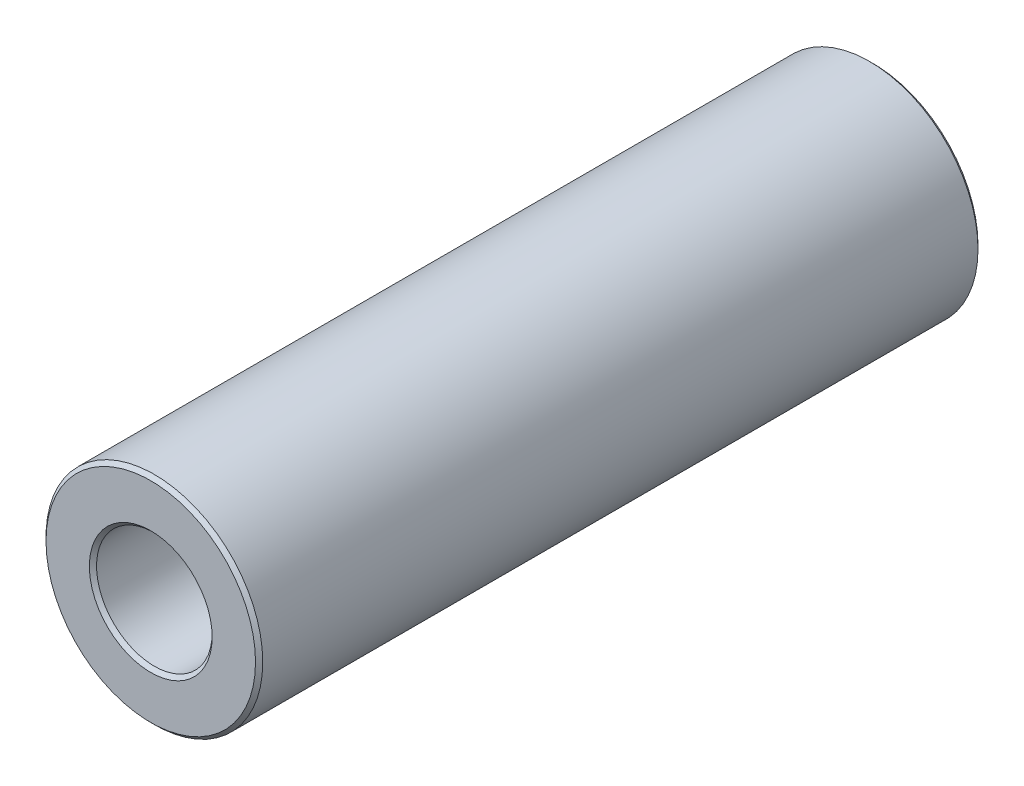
from build123d import *

# Parameters (mm, degrees)
SKETCH1_R           = 3
SKETCH1_R_2         = 1.6
BOSS_EXTRUDE2_DEPTH = 10
CHAMFER3_SIZE       = 0.1


with BuildPart() as part:
    # Sketch1 → Boss-Extrude2 (new, symmetric)
    with BuildSketch(Plane.XY):
        Circle(SKETCH1_R)
        Circle(SKETCH1_R_2, mode=Mode.SUBTRACT)
    extrude(amount=BOSS_EXTRUDE2_DEPTH, both=True)

    # Chamfer3
    chamfer3_edges = [part.edges().sort_by_distance(p)[0] for p in [
        (-3, 0, -10),
        (-3, 0, 10),
        (-1.6, 0, -10),
        (-1.6, 0, 10),
    ]]
    chamfer(chamfer3_edges, length=CHAMFER3_SIZE)


solid = part.part
